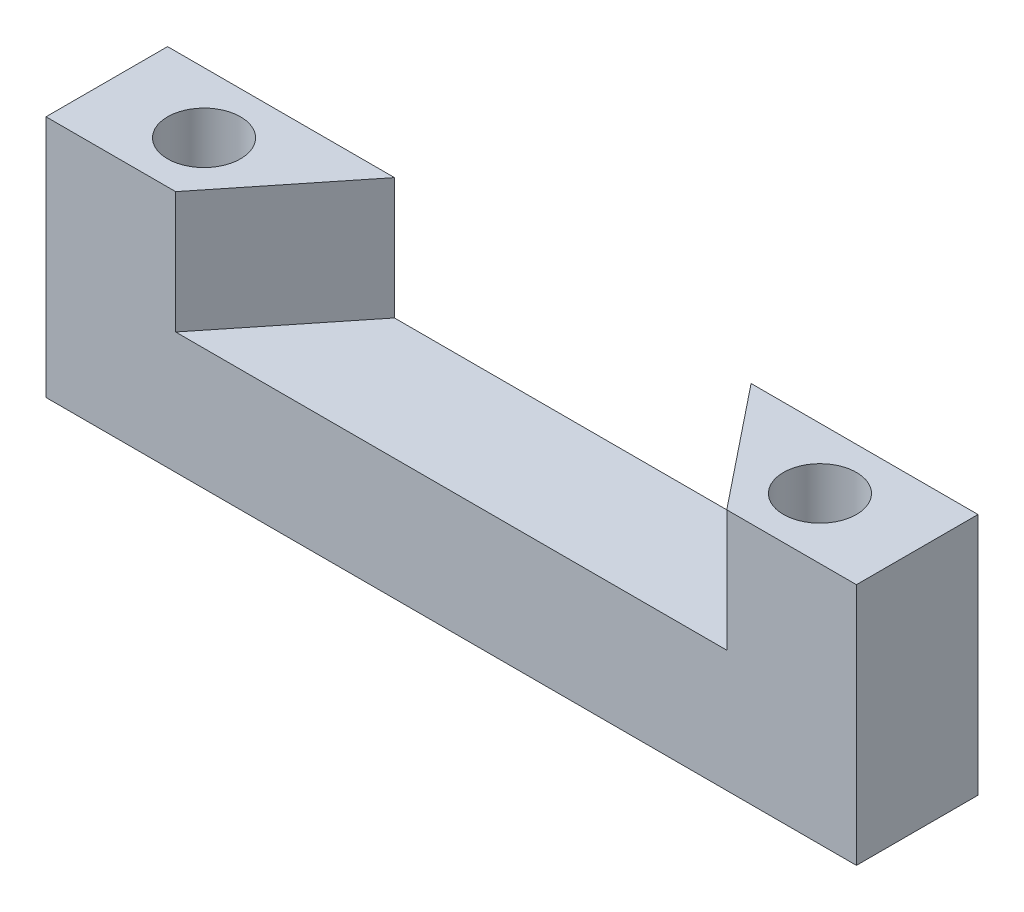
ISO-10303-21;
HEADER;
FILE_DESCRIPTION(('STEP AP214'),'2;1');
FILE_NAME('part.step','',(''),(''),'','','');
FILE_SCHEMA(('AUTOMOTIVE_DESIGN { 1 0 10303 214 1 1 1 1 }'));
ENDSEC;
DATA;
#1=APPLICATION_CONTEXT('core data for automotive mechanical design processes');
#2=APPLICATION_PROTOCOL_DEFINITION('international standard','automotive_design',2000,#1);
#3=PRODUCT_CONTEXT('',#1,'mechanical');
#4=PRODUCT('Part','Part','',(#3));
#5=PRODUCT_RELATED_PRODUCT_CATEGORY('part','',(#4));
#6=PRODUCT_DEFINITION_FORMATION('','',#4);
#7=PRODUCT_DEFINITION_CONTEXT('part definition',#1,'design');
#8=PRODUCT_DEFINITION('design','',#6,#7);
#9=PRODUCT_DEFINITION_SHAPE('','',#8);
#10=(LENGTH_UNIT() NAMED_UNIT(*) SI_UNIT(.MILLI.,.METRE.));
#11=(NAMED_UNIT(*) PLANE_ANGLE_UNIT() SI_UNIT($,.RADIAN.));
#12=(NAMED_UNIT(*) SI_UNIT($,.STERADIAN.) SOLID_ANGLE_UNIT());
#13=UNCERTAINTY_MEASURE_WITH_UNIT(LENGTH_MEASURE(1.E-05),#10,'distance_accuracy_value','');
#14=(GEOMETRIC_REPRESENTATION_CONTEXT(3) GLOBAL_UNCERTAINTY_ASSIGNED_CONTEXT((#13)) GLOBAL_UNIT_ASSIGNED_CONTEXT((#10,
#11,#12)) REPRESENTATION_CONTEXT('',''));
#15=CARTESIAN_POINT('',(0.,0.,0.));
#16=DIRECTION('',(0.,0.,1.));
#17=DIRECTION('',(1.,0.,0.));
#18=AXIS2_PLACEMENT_3D('',#15,#16,#17);
#19=CARTESIAN_POINT('',(-50.,15.,15.));
#20=DIRECTION('',(0.,-1.,0.));
#21=DIRECTION('',(0.,0.,-1.));
#22=AXIS2_PLACEMENT_3D('',#19,#20,#21);
#23=PLANE('',#22);
#24=DIRECTION('',(-1.,0.,0.));
#25=VECTOR('',#24,1.);
#26=CARTESIAN_POINT('',(-50.,15.,0.));
#27=LINE('',#26,#25);
#28=CARTESIAN_POINT('',(50.,15.,0.));
#29=VERTEX_POINT('',#28);
#30=CARTESIAN_POINT('',(22.,15.,0.));
#31=VERTEX_POINT('',#30);
#32=EDGE_CURVE('E145',#29,#31,#27,.T.);
#33=ORIENTED_EDGE('',*,*,#32,.T.);
#34=DIRECTION('',(0.624695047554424,0.,0.780868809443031));
#35=VECTOR('',#34,1.);
#36=CARTESIAN_POINT('',(22.,15.,0.));
#37=LINE('',#36,#35);
#38=CARTESIAN_POINT('',(34.,15.,15.));
#39=VERTEX_POINT('',#38);
#40=EDGE_CURVE('E118',#31,#39,#37,.T.);
#41=ORIENTED_EDGE('',*,*,#40,.T.);
#42=DIRECTION('',(-1.,0.,0.));
#43=VECTOR('',#42,1.);
#44=CARTESIAN_POINT('',(-50.,15.,15.));
#45=LINE('',#44,#43);
#46=CARTESIAN_POINT('',(50.,15.,15.));
#47=VERTEX_POINT('',#46);
#48=EDGE_CURVE('E154',#47,#39,#45,.T.);
#49=ORIENTED_EDGE('',*,*,#48,.F.);
#50=DIRECTION('',(0.,0.,-1.));
#51=VECTOR('',#50,1.);
#52=CARTESIAN_POINT('',(50.,15.,15.));
#53=LINE('',#52,#51);
#54=EDGE_CURVE('E159',#47,#29,#53,.T.);
#55=ORIENTED_EDGE('',*,*,#54,.T.);
#56=EDGE_LOOP('',(#33,#41,#49,#55));
#57=FACE_BOUND('',#56,.T.);
#58=CARTESIAN_POINT('',(38.,15.,7.50000000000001));
#59=DIRECTION('',(0.,-1.,0.));
#60=DIRECTION('',(0.,0.,1.));
#61=AXIS2_PLACEMENT_3D('',#58,#59,#60);
#62=CIRCLE('',#61,4.5);
#63=CARTESIAN_POINT('',(38.,15.,12.));
#64=VERTEX_POINT('',#63);
#65=EDGE_CURVE('E198',#64,#64,#62,.T.);
#66=ORIENTED_EDGE('',*,*,#65,.T.);
#67=EDGE_LOOP('',(#66));
#68=FACE_BOUND('',#67,.T.);
#69=ADVANCED_FACE('F39',(#57,#68),#23,.F.);
#70=CARTESIAN_POINT('',(-50.,-15.,15.));
#71=DIRECTION('',(0.,1.,0.));
#72=DIRECTION('',(0.,0.,1.));
#73=AXIS2_PLACEMENT_3D('',#70,#71,#72);
#74=PLANE('',#73);
#75=DIRECTION('',(1.,0.,0.));
#76=VECTOR('',#75,1.);
#77=CARTESIAN_POINT('',(-50.,-15.,0.));
#78=LINE('',#77,#76);
#79=CARTESIAN_POINT('',(-50.,-15.,0.));
#80=VERTEX_POINT('',#79);
#81=CARTESIAN_POINT('',(50.,-15.,0.));
#82=VERTEX_POINT('',#81);
#83=EDGE_CURVE('E170',#80,#82,#78,.T.);
#84=ORIENTED_EDGE('',*,*,#83,.T.);
#85=DIRECTION('',(0.,0.,-1.));
#86=VECTOR('',#85,1.);
#87=CARTESIAN_POINT('',(50.,-15.,15.));
#88=LINE('',#87,#86);
#89=CARTESIAN_POINT('',(50.,-15.,15.));
#90=VERTEX_POINT('',#89);
#91=EDGE_CURVE('E122',#90,#82,#88,.T.);
#92=ORIENTED_EDGE('',*,*,#91,.F.);
#93=DIRECTION('',(1.,0.,0.));
#94=VECTOR('',#93,1.);
#95=CARTESIAN_POINT('',(-50.,-15.,15.));
#96=LINE('',#95,#94);
#97=CARTESIAN_POINT('',(-50.,-15.,15.));
#98=VERTEX_POINT('',#97);
#99=EDGE_CURVE('E162',#98,#90,#96,.T.);
#100=ORIENTED_EDGE('',*,*,#99,.F.);
#101=DIRECTION('',(0.,0.,-1.));
#102=VECTOR('',#101,1.);
#103=CARTESIAN_POINT('',(-50.,-15.,15.));
#104=LINE('',#103,#102);
#105=EDGE_CURVE('E119',#98,#80,#104,.T.);
#106=ORIENTED_EDGE('',*,*,#105,.T.);
#107=EDGE_LOOP('',(#84,#92,#100,#106));
#108=FACE_BOUND('',#107,.T.);
#109=CARTESIAN_POINT('',(-38.,-15.,7.50000000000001));
#110=DIRECTION('',(0.,1.,0.));
#111=DIRECTION('',(0.,0.,1.));
#112=AXIS2_PLACEMENT_3D('',#109,#110,#111);
#113=CIRCLE('',#112,4.5);
#114=CARTESIAN_POINT('',(-38.,-15.,12.));
#115=VERTEX_POINT('',#114);
#116=EDGE_CURVE('E192',#115,#115,#113,.T.);
#117=ORIENTED_EDGE('',*,*,#116,.T.);
#118=EDGE_LOOP('',(#117));
#119=FACE_BOUND('',#118,.T.);
#120=CARTESIAN_POINT('',(38.,-15.,7.50000000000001));
#121=DIRECTION('',(0.,-1.,0.));
#122=DIRECTION('',(0.,0.,1.));
#123=AXIS2_PLACEMENT_3D('',#120,#121,#122);
#124=CIRCLE('',#123,4.5);
#125=CARTESIAN_POINT('',(38.,-15.,12.));
#126=VERTEX_POINT('',#125);
#127=EDGE_CURVE('E195',#126,#126,#124,.T.);
#128=ORIENTED_EDGE('',*,*,#127,.F.);
#129=EDGE_LOOP('',(#128));
#130=FACE_BOUND('',#129,.T.);
#131=ADVANCED_FACE('F185',(#108,#119,#130),#74,.F.);
#132=CARTESIAN_POINT('',(-38.,15.,7.50000000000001));
#133=DIRECTION('',(0.,1.,0.));
#134=DIRECTION('',(0.,0.,1.));
#135=AXIS2_PLACEMENT_3D('',#132,#133,#134);
#136=CIRCLE('',#135,4.5);
#137=CARTESIAN_POINT('',(-38.,15.,12.));
#138=VERTEX_POINT('',#137);
#139=EDGE_CURVE('E197',#138,#138,#136,.T.);
#140=ORIENTED_EDGE('',*,*,#139,.F.);
#141=EDGE_LOOP('',(#140));
#142=FACE_BOUND('',#141,.T.);
#143=CARTESIAN_POINT('',(-34.,15.,15.));
#144=VERTEX_POINT('',#143);
#145=CARTESIAN_POINT('',(-50.,15.,15.));
#146=VERTEX_POINT('',#145);
#147=EDGE_CURVE('E139',#144,#146,#45,.T.);
#148=ORIENTED_EDGE('',*,*,#147,.F.);
#149=DIRECTION('',(0.624695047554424,0.,-0.780868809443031));
#150=VECTOR('',#149,1.);
#151=CARTESIAN_POINT('',(-22.,15.,0.));
#152=LINE('',#151,#150);
#153=CARTESIAN_POINT('',(-22.,15.,0.));
#154=VERTEX_POINT('',#153);
#155=EDGE_CURVE('E106',#144,#154,#152,.T.);
#156=ORIENTED_EDGE('',*,*,#155,.T.);
#157=CARTESIAN_POINT('',(-50.,15.,0.));
#158=VERTEX_POINT('',#157);
#159=EDGE_CURVE('E137',#154,#158,#27,.T.);
#160=ORIENTED_EDGE('',*,*,#159,.T.);
#161=DIRECTION('',(0.,0.,-1.));
#162=VECTOR('',#161,1.);
#163=CARTESIAN_POINT('',(-50.,15.,15.));
#164=LINE('',#163,#162);
#165=EDGE_CURVE('E157',#146,#158,#164,.T.);
#166=ORIENTED_EDGE('',*,*,#165,.F.);
#167=EDGE_LOOP('',(#148,#156,#160,#166));
#168=FACE_BOUND('',#167,.T.);
#169=ADVANCED_FACE('F135',(#142,#168),#23,.F.);
#170=CARTESIAN_POINT('',(-50.,15.,15.));
#171=DIRECTION('',(0.,0.,-1.));
#172=DIRECTION('',(-1.,0.,0.));
#173=AXIS2_PLACEMENT_3D('',#170,#171,#172);
#174=PLANE('',#173);
#175=ORIENTED_EDGE('',*,*,#48,.T.);
#176=DIRECTION('',(0.,-1.,0.));
#177=VECTOR('',#176,1.);
#178=CARTESIAN_POINT('',(34.,0.,15.));
#179=LINE('',#178,#177);
#180=CARTESIAN_POINT('',(34.,0.,15.));
#181=VERTEX_POINT('',#180);
#182=EDGE_CURVE('E130',#39,#181,#179,.T.);
#183=ORIENTED_EDGE('',*,*,#182,.T.);
#184=DIRECTION('',(1.,0.,0.));
#185=VECTOR('',#184,1.);
#186=CARTESIAN_POINT('',(-22.,0.,15.));
#187=LINE('',#186,#185);
#188=CARTESIAN_POINT('',(-34.,0.,15.));
#189=VERTEX_POINT('',#188);
#190=EDGE_CURVE('E53',#189,#181,#187,.T.);
#191=ORIENTED_EDGE('',*,*,#190,.F.);
#192=DIRECTION('',(0.,1.,0.));
#193=VECTOR('',#192,1.);
#194=CARTESIAN_POINT('',(-34.,15.,15.));
#195=LINE('',#194,#193);
#196=EDGE_CURVE('E128',#189,#144,#195,.T.);
#197=ORIENTED_EDGE('',*,*,#196,.T.);
#198=ORIENTED_EDGE('',*,*,#147,.T.);
#199=DIRECTION('',(0.,-1.,0.));
#200=VECTOR('',#199,1.);
#201=CARTESIAN_POINT('',(-50.,-15.,15.));
#202=LINE('',#201,#200);
#203=EDGE_CURVE('E152',#146,#98,#202,.T.);
#204=ORIENTED_EDGE('',*,*,#203,.T.);
#205=ORIENTED_EDGE('',*,*,#99,.T.);
#206=DIRECTION('',(0.,1.,0.));
#207=VECTOR('',#206,1.);
#208=CARTESIAN_POINT('',(50.,-15.,15.));
#209=LINE('',#208,#207);
#210=EDGE_CURVE('E155',#90,#47,#209,.T.);
#211=ORIENTED_EDGE('',*,*,#210,.T.);
#212=EDGE_LOOP('',(#175,#183,#191,#197,#198,#204,#205,#211));
#213=FACE_BOUND('',#212,.T.);
#214=ADVANCED_FACE('F149',(#213),#174,.F.);
#215=CARTESIAN_POINT('',(-50.,15.,0.));
#216=DIRECTION('',(0.,0.,-1.));
#217=DIRECTION('',(-1.,0.,0.));
#218=AXIS2_PLACEMENT_3D('',#215,#216,#217);
#219=PLANE('',#218);
#220=ORIENTED_EDGE('',*,*,#159,.F.);
#221=DIRECTION('',(0.,-1.,0.));
#222=VECTOR('',#221,1.);
#223=CARTESIAN_POINT('',(-22.,15.,0.));
#224=LINE('',#223,#222);
#225=CARTESIAN_POINT('',(-22.,0.,0.));
#226=VERTEX_POINT('',#225);
#227=EDGE_CURVE('E115',#154,#226,#224,.T.);
#228=ORIENTED_EDGE('',*,*,#227,.T.);
#229=DIRECTION('',(1.,0.,0.));
#230=VECTOR('',#229,1.);
#231=CARTESIAN_POINT('',(-50.,0.,0.));
#232=LINE('',#231,#230);
#233=CARTESIAN_POINT('',(22.,0.,0.));
#234=VERTEX_POINT('',#233);
#235=EDGE_CURVE('E101',#226,#234,#232,.T.);
#236=ORIENTED_EDGE('',*,*,#235,.T.);
#237=DIRECTION('',(0.,1.,0.));
#238=VECTOR('',#237,1.);
#239=CARTESIAN_POINT('',(22.,15.,0.));
#240=LINE('',#239,#238);
#241=EDGE_CURVE('E112',#234,#31,#240,.T.);
#242=ORIENTED_EDGE('',*,*,#241,.T.);
#243=ORIENTED_EDGE('',*,*,#32,.F.);
#244=DIRECTION('',(0.,1.,0.));
#245=VECTOR('',#244,1.);
#246=CARTESIAN_POINT('',(50.,-15.,0.));
#247=LINE('',#246,#245);
#248=EDGE_CURVE('E146',#82,#29,#247,.T.);
#249=ORIENTED_EDGE('',*,*,#248,.F.);
#250=ORIENTED_EDGE('',*,*,#83,.F.);
#251=DIRECTION('',(0.,-1.,0.));
#252=VECTOR('',#251,1.);
#253=CARTESIAN_POINT('',(-50.,-15.,0.));
#254=LINE('',#253,#252);
#255=EDGE_CURVE('E144',#158,#80,#254,.T.);
#256=ORIENTED_EDGE('',*,*,#255,.F.);
#257=EDGE_LOOP('',(#220,#228,#236,#242,#243,#249,#250,#256));
#258=FACE_BOUND('',#257,.T.);
#259=ADVANCED_FACE('F110',(#258),#219,.T.);
#260=CARTESIAN_POINT('',(-50.,-15.,15.));
#261=DIRECTION('',(1.,0.,0.));
#262=DIRECTION('',(0.,0.,-1.));
#263=AXIS2_PLACEMENT_3D('',#260,#261,#262);
#264=PLANE('',#263);
#265=ORIENTED_EDGE('',*,*,#255,.T.);
#266=ORIENTED_EDGE('',*,*,#105,.F.);
#267=ORIENTED_EDGE('',*,*,#203,.F.);
#268=ORIENTED_EDGE('',*,*,#165,.T.);
#269=EDGE_LOOP('',(#265,#266,#267,#268));
#270=FACE_BOUND('',#269,.T.);
#271=ADVANCED_FACE('F161',(#270),#264,.F.);
#272=CARTESIAN_POINT('',(50.,-15.,15.));
#273=DIRECTION('',(-1.,0.,0.));
#274=DIRECTION('',(0.,0.,1.));
#275=AXIS2_PLACEMENT_3D('',#272,#273,#274);
#276=PLANE('',#275);
#277=ORIENTED_EDGE('',*,*,#248,.T.);
#278=ORIENTED_EDGE('',*,*,#54,.F.);
#279=ORIENTED_EDGE('',*,*,#210,.F.);
#280=ORIENTED_EDGE('',*,*,#91,.T.);
#281=EDGE_LOOP('',(#277,#278,#279,#280));
#282=FACE_BOUND('',#281,.T.);
#283=ADVANCED_FACE('F179',(#282),#276,.F.);
#284=CARTESIAN_POINT('',(-22.,0.,15.));
#285=DIRECTION('',(0.,1.,0.));
#286=DIRECTION('',(0.,0.,1.));
#287=AXIS2_PLACEMENT_3D('',#284,#285,#286);
#288=PLANE('',#287);
#289=ORIENTED_EDGE('',*,*,#235,.F.);
#290=DIRECTION('',(-0.624695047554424,0.,0.780868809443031));
#291=VECTOR('',#290,1.);
#292=CARTESIAN_POINT('',(-22.,0.,0.));
#293=LINE('',#292,#291);
#294=EDGE_CURVE('E11',#226,#189,#293,.T.);
#295=ORIENTED_EDGE('',*,*,#294,.T.);
#296=ORIENTED_EDGE('',*,*,#190,.T.);
#297=DIRECTION('',(-0.624695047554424,0.,-0.780868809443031));
#298=VECTOR('',#297,1.);
#299=CARTESIAN_POINT('',(22.,0.,0.));
#300=LINE('',#299,#298);
#301=EDGE_CURVE('E47',#181,#234,#300,.T.);
#302=ORIENTED_EDGE('',*,*,#301,.T.);
#303=EDGE_LOOP('',(#289,#295,#296,#302));
#304=FACE_BOUND('',#303,.T.);
#305=ADVANCED_FACE('F100',(#304),#288,.T.);
#306=CARTESIAN_POINT('',(-38.,-15.,7.50000000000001));
#307=DIRECTION('',(0.,1.,0.));
#308=DIRECTION('',(0.,0.,1.));
#309=AXIS2_PLACEMENT_3D('',#306,#307,#308);
#310=CYLINDRICAL_SURFACE('',#309,4.5);
#311=ORIENTED_EDGE('',*,*,#116,.F.);
#312=EDGE_LOOP('',(#311));
#313=FACE_BOUND('',#312,.T.);
#314=ORIENTED_EDGE('',*,*,#139,.T.);
#315=EDGE_LOOP('',(#314));
#316=FACE_BOUND('',#315,.T.);
#317=ADVANCED_FACE('F208',(#313,#316),#310,.F.);
#318=CARTESIAN_POINT('',(38.,-15.,7.50000000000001));
#319=DIRECTION('',(0.,1.,0.));
#320=DIRECTION('',(0.,0.,1.));
#321=AXIS2_PLACEMENT_3D('',#318,#319,#320);
#322=CYLINDRICAL_SURFACE('',#321,4.5);
#323=ORIENTED_EDGE('',*,*,#127,.T.);
#324=EDGE_LOOP('',(#323));
#325=FACE_BOUND('',#324,.T.);
#326=ORIENTED_EDGE('',*,*,#65,.F.);
#327=EDGE_LOOP('',(#326));
#328=FACE_BOUND('',#327,.T.);
#329=ADVANCED_FACE('F206',(#325,#328),#322,.F.);
#330=CARTESIAN_POINT('',(22.,0.,0.));
#331=DIRECTION('',(-0.780868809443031,0.,0.624695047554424));
#332=DIRECTION('',(0.624695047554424,0.,0.780868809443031));
#333=AXIS2_PLACEMENT_3D('',#330,#331,#332);
#334=PLANE('',#333);
#335=ORIENTED_EDGE('',*,*,#301,.F.);
#336=ORIENTED_EDGE('',*,*,#182,.F.);
#337=ORIENTED_EDGE('',*,*,#40,.F.);
#338=ORIENTED_EDGE('',*,*,#241,.F.);
#339=EDGE_LOOP('',(#335,#336,#337,#338));
#340=FACE_BOUND('',#339,.T.);
#341=ADVANCED_FACE('F117',(#340),#334,.T.);
#342=CARTESIAN_POINT('',(-22.,15.,0.));
#343=DIRECTION('',(0.780868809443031,0.,0.624695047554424));
#344=DIRECTION('',(0.624695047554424,0.,-0.780868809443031));
#345=AXIS2_PLACEMENT_3D('',#342,#343,#344);
#346=PLANE('',#345);
#347=ORIENTED_EDGE('',*,*,#155,.F.);
#348=ORIENTED_EDGE('',*,*,#196,.F.);
#349=ORIENTED_EDGE('',*,*,#294,.F.);
#350=ORIENTED_EDGE('',*,*,#227,.F.);
#351=EDGE_LOOP('',(#347,#348,#349,#350));
#352=FACE_BOUND('',#351,.T.);
#353=ADVANCED_FACE('F41',(#352),#346,.T.);
#354=CLOSED_SHELL('',(#69,#131,#169,#214,#259,#271,#283,#305,#317,#329,#341,#353));
#355=MANIFOLD_SOLID_BREP('B2',#354);
#356=ADVANCED_BREP_SHAPE_REPRESENTATION('',(#18,#355),#14);
#357=SHAPE_DEFINITION_REPRESENTATION(#9,#356);
ENDSEC;
END-ISO-10303-21;
